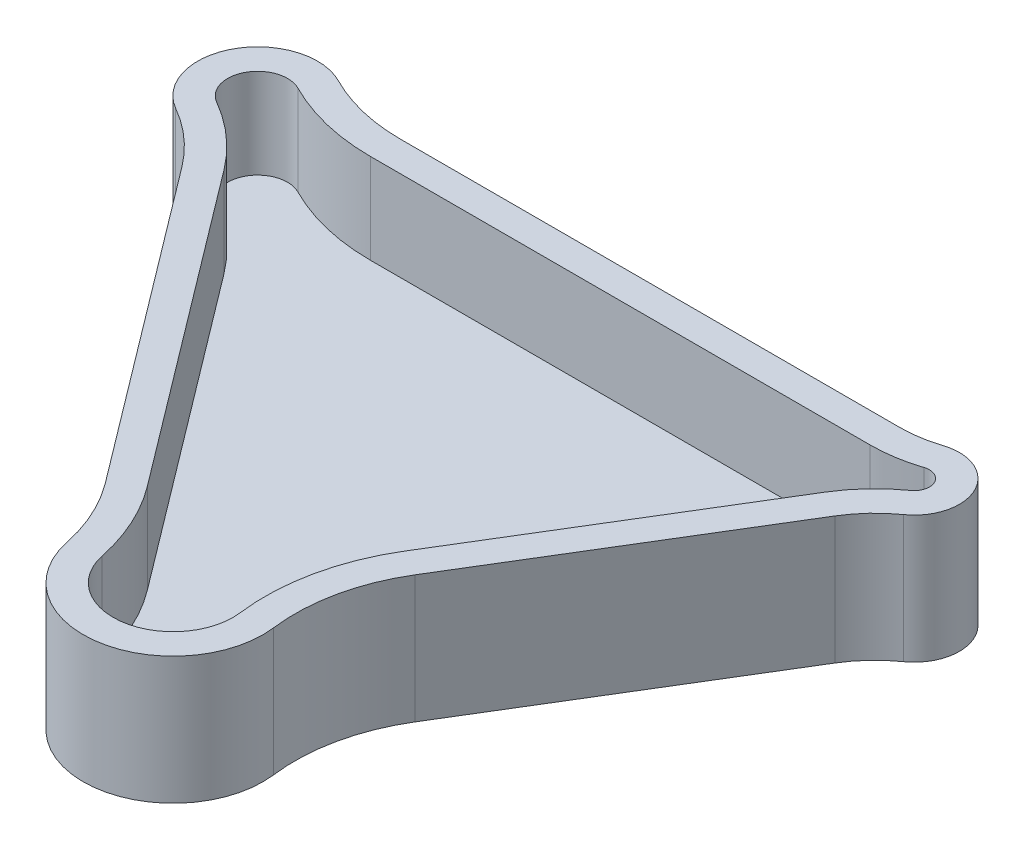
ISO-10303-21;
HEADER;
FILE_DESCRIPTION(('STEP AP214'),'2;1');
FILE_NAME('part.step','',(''),(''),'','','');
FILE_SCHEMA(('AUTOMOTIVE_DESIGN { 1 0 10303 214 1 1 1 1 }'));
ENDSEC;
DATA;
#1=APPLICATION_CONTEXT('core data for automotive mechanical design processes');
#2=APPLICATION_PROTOCOL_DEFINITION('international standard','automotive_design',2000,#1);
#3=PRODUCT_CONTEXT('',#1,'mechanical');
#4=PRODUCT('Part','Part','',(#3));
#5=PRODUCT_RELATED_PRODUCT_CATEGORY('part','',(#4));
#6=PRODUCT_DEFINITION_FORMATION('','',#4);
#7=PRODUCT_DEFINITION_CONTEXT('part definition',#1,'design');
#8=PRODUCT_DEFINITION('design','',#6,#7);
#9=PRODUCT_DEFINITION_SHAPE('','',#8);
#10=(LENGTH_UNIT() NAMED_UNIT(*) SI_UNIT(.MILLI.,.METRE.));
#11=(NAMED_UNIT(*) PLANE_ANGLE_UNIT() SI_UNIT($,.RADIAN.));
#12=(NAMED_UNIT(*) SI_UNIT($,.STERADIAN.) SOLID_ANGLE_UNIT());
#13=UNCERTAINTY_MEASURE_WITH_UNIT(LENGTH_MEASURE(1.E-05),#10,'distance_accuracy_value','');
#14=(GEOMETRIC_REPRESENTATION_CONTEXT(3) GLOBAL_UNCERTAINTY_ASSIGNED_CONTEXT((#13)) GLOBAL_UNIT_ASSIGNED_CONTEXT((#10,
#11,#12)) REPRESENTATION_CONTEXT('',''));
#15=CARTESIAN_POINT('',(0.,0.,0.));
#16=DIRECTION('',(0.,0.,1.));
#17=DIRECTION('',(1.,0.,0.));
#18=AXIS2_PLACEMENT_3D('',#15,#16,#17);
#19=CARTESIAN_POINT('',(-65.3082975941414,15.875,-204.297699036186));
#20=DIRECTION('',(0.,-1.,0.));
#21=DIRECTION('',(0.,0.,-1.));
#22=AXIS2_PLACEMENT_3D('',#19,#20,#21);
#23=CYLINDRICAL_SURFACE('',#22,76.2);
#24=CARTESIAN_POINT('',(-65.3082975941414,0.,-204.297699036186));
#25=DIRECTION('',(0.,-1.,0.));
#26=DIRECTION('',(0.,0.,-1.));
#27=AXIS2_PLACEMENT_3D('',#24,#25,#26);
#28=CIRCLE('',#27,76.2);
#29=CARTESIAN_POINT('',(-65.3082975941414,0.,-128.097699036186));
#30=VERTEX_POINT('',#29);
#31=CARTESIAN_POINT('',(-99.9059419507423,0.,-136.404820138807));
#32=VERTEX_POINT('',#31);
#33=EDGE_CURVE('E390',#30,#32,#28,.T.);
#34=ORIENTED_EDGE('',*,*,#33,.T.);
#35=DIRECTION('',(0.,-1.,0.));
#36=VECTOR('',#35,1.);
#37=CARTESIAN_POINT('',(-99.9059419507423,15.875,-136.404820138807));
#38=LINE('',#37,#36);
#39=CARTESIAN_POINT('',(-99.9059419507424,53.975,-136.404820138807));
#40=VERTEX_POINT('',#39);
#41=EDGE_CURVE('E12',#40,#32,#38,.T.);
#42=ORIENTED_EDGE('',*,*,#41,.F.);
#43=CARTESIAN_POINT('',(-65.3082975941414,53.975,-204.297699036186));
#44=DIRECTION('',(0.,-1.,0.));
#45=DIRECTION('',(0.,0.,1.));
#46=AXIS2_PLACEMENT_3D('',#43,#44,#45);
#47=CIRCLE('',#46,76.2);
#48=CARTESIAN_POINT('',(-65.3082975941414,53.975,-128.097699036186));
#49=VERTEX_POINT('',#48);
#50=EDGE_CURVE('E387',#49,#40,#47,.T.);
#51=ORIENTED_EDGE('',*,*,#50,.F.);
#52=DIRECTION('',(0.,-1.,0.));
#53=VECTOR('',#52,1.);
#54=CARTESIAN_POINT('',(-65.3082975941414,15.875,-128.097699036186));
#55=LINE('',#54,#53);
#56=EDGE_CURVE('E414',#49,#30,#55,.T.);
#57=ORIENTED_EDGE('',*,*,#56,.T.);
#58=EDGE_LOOP('',(#34,#42,#51,#57));
#59=FACE_BOUND('',#58,.T.);
#60=ADVANCED_FACE('F98',(#59),#23,.F.);
#61=CARTESIAN_POINT('',(-111.438490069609,15.875,-113.773860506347));
#62=DIRECTION('',(0.,-1.,0.));
#63=DIRECTION('',(0.,0.,-1.));
#64=AXIS2_PLACEMENT_3D('',#61,#62,#63);
#65=CYLINDRICAL_SURFACE('',#64,25.4);
#66=CARTESIAN_POINT('',(-111.438490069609,0.,-113.773860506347));
#67=DIRECTION('',(0.,1.,0.));
#68=DIRECTION('',(0.,0.,1.));
#69=AXIS2_PLACEMENT_3D('',#66,#67,#68);
#70=CIRCLE('',#69,25.4);
#71=CARTESIAN_POINT('',(-124.137797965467,0.,-91.7764156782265));
#72=VERTEX_POINT('',#71);
#73=EDGE_CURVE('E393',#32,#72,#70,.T.);
#74=ORIENTED_EDGE('',*,*,#73,.T.);
#75=DIRECTION('',(0.,-1.,0.));
#76=VECTOR('',#75,1.);
#77=CARTESIAN_POINT('',(-124.137797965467,15.875,-91.7764156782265));
#78=LINE('',#77,#76);
#79=CARTESIAN_POINT('',(-124.137797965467,53.975,-91.7764156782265));
#80=VERTEX_POINT('',#79);
#81=EDGE_CURVE('E105',#80,#72,#78,.T.);
#82=ORIENTED_EDGE('',*,*,#81,.F.);
#83=CARTESIAN_POINT('',(-111.438490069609,53.975,-113.773860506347));
#84=DIRECTION('',(0.,1.,0.));
#85=DIRECTION('',(0.,0.,1.));
#86=AXIS2_PLACEMENT_3D('',#83,#84,#85);
#87=CIRCLE('',#86,25.4);
#88=EDGE_CURVE('E279',#40,#80,#87,.T.);
#89=ORIENTED_EDGE('',*,*,#88,.F.);
#90=ORIENTED_EDGE('',*,*,#41,.T.);
#91=EDGE_LOOP('',(#74,#82,#89,#90));
#92=FACE_BOUND('',#91,.T.);
#93=ADVANCED_FACE('F490',(#92),#65,.T.);
#94=CARTESIAN_POINT('',(-162.235721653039,15.875,-25.7840811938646));
#95=DIRECTION('',(0.,-1.,0.));
#96=DIRECTION('',(0.,0.,-1.));
#97=AXIS2_PLACEMENT_3D('',#94,#95,#96);
#98=CYLINDRICAL_SURFACE('',#97,76.2);
#99=CARTESIAN_POINT('',(-162.235721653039,0.,-25.7840811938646));
#100=DIRECTION('',(0.,-1.,0.));
#101=DIRECTION('',(0.,0.,1.));
#102=AXIS2_PLACEMENT_3D('',#99,#100,#101);
#103=CIRCLE('',#102,76.2);
#104=CARTESIAN_POINT('',(-101.411749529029,0.,-71.6848918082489));
#105=VERTEX_POINT('',#104);
#106=EDGE_CURVE('E395',#72,#105,#103,.T.);
#107=ORIENTED_EDGE('',*,*,#106,.T.);
#108=DIRECTION('',(0.,-1.,0.));
#109=VECTOR('',#108,1.);
#110=CARTESIAN_POINT('',(-101.411749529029,15.875,-71.6848918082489));
#111=LINE('',#110,#109);
#112=CARTESIAN_POINT('',(-101.411749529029,53.975,-71.6848918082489));
#113=VERTEX_POINT('',#112);
#114=EDGE_CURVE('E439',#113,#105,#111,.T.);
#115=ORIENTED_EDGE('',*,*,#114,.F.);
#116=CARTESIAN_POINT('',(-162.235721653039,53.975,-25.7840811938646));
#117=DIRECTION('',(0.,-1.,0.));
#118=DIRECTION('',(0.,0.,1.));
#119=AXIS2_PLACEMENT_3D('',#116,#117,#118);
#120=CIRCLE('',#119,76.2);
#121=EDGE_CURVE('E357',#80,#113,#120,.T.);
#122=ORIENTED_EDGE('',*,*,#121,.F.);
#123=ORIENTED_EDGE('',*,*,#81,.T.);
#124=EDGE_LOOP('',(#107,#115,#122,#123));
#125=FACE_BOUND('',#124,.T.);
#126=ADVANCED_FACE('F445',(#125),#98,.F.);
#127=CARTESIAN_POINT('',(-1.65235802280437,15.875,60.508033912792));
#128=DIRECTION('',(0.798214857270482,0.,-0.602372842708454));
#129=DIRECTION('',(-0.602372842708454,0.,-0.798214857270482));
#130=AXIS2_PLACEMENT_3D('',#127,#128,#129);
#131=PLANE('',#130);
#132=DIRECTION('',(0.602372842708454,0.,0.798214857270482));
#133=VECTOR('',#132,1.);
#134=CARTESIAN_POINT('',(-1.65235802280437,0.,60.508033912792));
#135=LINE('',#134,#133);
#136=CARTESIAN_POINT('',(-1.65235802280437,0.,60.508033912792));
#137=VERTEX_POINT('',#136);
#138=EDGE_CURVE('E397',#105,#137,#135,.T.);
#139=ORIENTED_EDGE('',*,*,#138,.T.);
#140=DIRECTION('',(0.,-1.,0.));
#141=VECTOR('',#140,1.);
#142=CARTESIAN_POINT('',(-1.65235802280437,15.875,60.508033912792));
#143=LINE('',#142,#141);
#144=CARTESIAN_POINT('',(-1.65235802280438,53.975,60.508033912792));
#145=VERTEX_POINT('',#144);
#146=EDGE_CURVE('E436',#145,#137,#143,.T.);
#147=ORIENTED_EDGE('',*,*,#146,.F.);
#148=DIRECTION('',(0.602372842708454,0.,0.798214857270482));
#149=VECTOR('',#148,1.);
#150=CARTESIAN_POINT('',(-101.411749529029,53.975,-71.6848918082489));
#151=LINE('',#150,#149);
#152=EDGE_CURVE('E360',#113,#145,#151,.T.);
#153=ORIENTED_EDGE('',*,*,#152,.F.);
#154=ORIENTED_EDGE('',*,*,#114,.T.);
#155=EDGE_LOOP('',(#139,#147,#153,#154));
#156=FACE_BOUND('',#155,.T.);
#157=ADVANCED_FACE('F455',(#156),#131,.F.);
#158=CARTESIAN_POINT('',(-62.4763301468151,15.875,106.408844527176));
#159=DIRECTION('',(0.,-1.,0.));
#160=DIRECTION('',(0.,0.,-1.));
#161=AXIS2_PLACEMENT_3D('',#158,#159,#160);
#162=CYLINDRICAL_SURFACE('',#161,76.2);
#163=CARTESIAN_POINT('',(-62.4763301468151,0.,106.408844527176));
#164=DIRECTION('',(0.,-1.,0.));
#165=DIRECTION('',(0.,0.,1.));
#166=AXIS2_PLACEMENT_3D('',#163,#164,#165);
#167=CIRCLE('',#166,76.2);
#168=CARTESIAN_POINT('',(12.0862435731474,0.,90.6969827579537));
#169=VERTEX_POINT('',#168);
#170=EDGE_CURVE('E399',#137,#169,#167,.T.);
#171=ORIENTED_EDGE('',*,*,#170,.T.);
#172=DIRECTION('',(0.,-1.,0.));
#173=VECTOR('',#172,1.);
#174=CARTESIAN_POINT('',(12.0862435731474,15.875,90.6969827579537));
#175=LINE('',#174,#173);
#176=CARTESIAN_POINT('',(12.0862435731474,53.975,90.6969827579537));
#177=VERTEX_POINT('',#176);
#178=EDGE_CURVE('E433',#177,#169,#175,.T.);
#179=ORIENTED_EDGE('',*,*,#178,.F.);
#180=CARTESIAN_POINT('',(-62.4763301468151,53.975,106.408844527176));
#181=DIRECTION('',(0.,-1.,0.));
#182=DIRECTION('',(0.,0.,1.));
#183=AXIS2_PLACEMENT_3D('',#180,#181,#182);
#184=CIRCLE('',#183,76.2);
#185=EDGE_CURVE('E363',#145,#177,#184,.T.);
#186=ORIENTED_EDGE('',*,*,#185,.F.);
#187=ORIENTED_EDGE('',*,*,#146,.T.);
#188=EDGE_LOOP('',(#171,#179,#186,#187));
#189=FACE_BOUND('',#188,.T.);
#190=ADVANCED_FACE('F459',(#189),#162,.F.);
#191=CARTESIAN_POINT('',(49.3675304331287,15.875,82.8410518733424));
#192=DIRECTION('',(0.,-1.,0.));
#193=DIRECTION('',(0.,0.,-1.));
#194=AXIS2_PLACEMENT_3D('',#191,#192,#193);
#195=CYLINDRICAL_SURFACE('',#194,38.1);
#196=CARTESIAN_POINT('',(49.3675304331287,0.,82.8410518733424));
#197=DIRECTION('',(0.,1.,0.));
#198=DIRECTION('',(0.,0.,-1.));
#199=AXIS2_PLACEMENT_3D('',#196,#197,#198);
#200=CIRCLE('',#199,38.1);
#201=CARTESIAN_POINT('',(87.1602823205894,0.,78.0121902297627));
#202=VERTEX_POINT('',#201);
#203=EDGE_CURVE('E401',#169,#202,#200,.T.);
#204=ORIENTED_EDGE('',*,*,#203,.T.);
#205=DIRECTION('',(0.,-1.,0.));
#206=VECTOR('',#205,1.);
#207=CARTESIAN_POINT('',(87.1602823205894,15.875,78.0121902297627));
#208=LINE('',#207,#206);
#209=CARTESIAN_POINT('',(87.1602823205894,53.975,78.0121902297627));
#210=VERTEX_POINT('',#209);
#211=EDGE_CURVE('E430',#210,#202,#208,.T.);
#212=ORIENTED_EDGE('',*,*,#211,.F.);
#213=CARTESIAN_POINT('',(49.3675304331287,53.975,82.8410518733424));
#214=DIRECTION('',(0.,1.,0.));
#215=DIRECTION('',(0.,0.,1.));
#216=AXIS2_PLACEMENT_3D('',#213,#214,#215);
#217=CIRCLE('',#216,38.1);
#218=EDGE_CURVE('E366',#177,#210,#217,.T.);
#219=ORIENTED_EDGE('',*,*,#218,.F.);
#220=ORIENTED_EDGE('',*,*,#178,.T.);
#221=EDGE_LOOP('',(#204,#212,#219,#220));
#222=FACE_BOUND('',#221,.T.);
#223=ADVANCED_FACE('F466',(#222),#195,.T.);
#224=CARTESIAN_POINT('',(162.745786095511,15.875,68.3544669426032));
#225=DIRECTION('',(0.,-1.,0.));
#226=DIRECTION('',(0.,0.,-1.));
#227=AXIS2_PLACEMENT_3D('',#224,#225,#226);
#228=CYLINDRICAL_SURFACE('',#227,76.2);
#229=CARTESIAN_POINT('',(162.745786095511,0.,68.3544669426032));
#230=DIRECTION('',(0.,-1.,0.));
#231=DIRECTION('',(0.,0.,1.));
#232=AXIS2_PLACEMENT_3D('',#229,#230,#231);
#233=CIRCLE('',#232,76.2);
#234=CARTESIAN_POINT('',(97.6662128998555,0.,28.717499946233));
#235=VERTEX_POINT('',#234);
#236=EDGE_CURVE('E403',#202,#235,#233,.T.);
#237=ORIENTED_EDGE('',*,*,#236,.T.);
#238=DIRECTION('',(0.,-1.,0.));
#239=VECTOR('',#238,1.);
#240=CARTESIAN_POINT('',(97.6662128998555,15.875,28.717499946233));
#241=LINE('',#240,#239);
#242=CARTESIAN_POINT('',(97.6662128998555,53.975,28.717499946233));
#243=VERTEX_POINT('',#242);
#244=EDGE_CURVE('E427',#243,#235,#241,.T.);
#245=ORIENTED_EDGE('',*,*,#244,.F.);
#246=CARTESIAN_POINT('',(162.745786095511,53.975,68.3544669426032));
#247=DIRECTION('',(0.,-1.,0.));
#248=DIRECTION('',(0.,0.,1.));
#249=AXIS2_PLACEMENT_3D('',#246,#247,#248);
#250=CIRCLE('',#249,76.2);
#251=EDGE_CURVE('E369',#210,#243,#250,.T.);
#252=ORIENTED_EDGE('',*,*,#251,.F.);
#253=ORIENTED_EDGE('',*,*,#211,.T.);
#254=EDGE_LOOP('',(#237,#245,#252,#253));
#255=FACE_BOUND('',#254,.T.);
#256=ADVANCED_FACE('F469',(#255),#228,.F.);
#257=CARTESIAN_POINT('',(165.026329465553,15.875,-81.8804586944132));
#258=DIRECTION('',(-0.85406264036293,0.,-0.52017017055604));
#259=DIRECTION('',(-0.52017017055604,0.,0.854062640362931));
#260=AXIS2_PLACEMENT_3D('',#257,#258,#259);
#261=PLANE('',#260);
#262=DIRECTION('',(0.52017017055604,0.,-0.85406264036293));
#263=VECTOR('',#262,1.);
#264=CARTESIAN_POINT('',(165.026329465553,0.,-81.8804586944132));
#265=LINE('',#264,#263);
#266=CARTESIAN_POINT('',(165.026329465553,0.,-81.8804586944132));
#267=VERTEX_POINT('',#266);
#268=EDGE_CURVE('E405',#235,#267,#265,.T.);
#269=ORIENTED_EDGE('',*,*,#268,.T.);
#270=DIRECTION('',(0.,-1.,0.));
#271=VECTOR('',#270,1.);
#272=CARTESIAN_POINT('',(165.026329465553,15.875,-81.8804586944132));
#273=LINE('',#272,#271);
#274=CARTESIAN_POINT('',(165.026329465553,53.975,-81.8804586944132));
#275=VERTEX_POINT('',#274);
#276=EDGE_CURVE('E424',#275,#267,#273,.T.);
#277=ORIENTED_EDGE('',*,*,#276,.F.);
#278=DIRECTION('',(0.52017017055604,0.,-0.854062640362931));
#279=VECTOR('',#278,1.);
#280=CARTESIAN_POINT('',(97.6662128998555,53.975,28.717499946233));
#281=LINE('',#280,#279);
#282=EDGE_CURVE('E372',#243,#275,#281,.T.);
#283=ORIENTED_EDGE('',*,*,#282,.F.);
#284=ORIENTED_EDGE('',*,*,#244,.T.);
#285=EDGE_LOOP('',(#269,#277,#283,#284));
#286=FACE_BOUND('',#285,.T.);
#287=ADVANCED_FACE('F474',(#286),#261,.F.);
#288=CARTESIAN_POINT('',(208.41271159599,15.875,-55.4558140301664));
#289=DIRECTION('',(0.,-1.,0.));
#290=DIRECTION('',(0.,0.,-1.));
#291=AXIS2_PLACEMENT_3D('',#288,#289,#290);
#292=CYLINDRICAL_SURFACE('',#291,50.8);
#293=CARTESIAN_POINT('',(208.41271159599,0.,-55.4558140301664));
#294=DIRECTION('',(0.,-1.,0.));
#295=DIRECTION('',(0.,0.,1.));
#296=AXIS2_PLACEMENT_3D('',#293,#294,#295);
#297=CIRCLE('',#296,50.8);
#298=CARTESIAN_POINT('',(179.098460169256,0.,-96.9445433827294));
#299=VERTEX_POINT('',#298);
#300=EDGE_CURVE('E407',#267,#299,#297,.T.);
#301=ORIENTED_EDGE('',*,*,#300,.T.);
#302=DIRECTION('',(0.,-1.,0.));
#303=VECTOR('',#302,1.);
#304=CARTESIAN_POINT('',(179.098460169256,15.875,-96.9445433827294));
#305=LINE('',#304,#303);
#306=CARTESIAN_POINT('',(179.098460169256,53.975,-96.9445433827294));
#307=VERTEX_POINT('',#306);
#308=EDGE_CURVE('E421',#307,#299,#305,.T.);
#309=ORIENTED_EDGE('',*,*,#308,.F.);
#310=CARTESIAN_POINT('',(208.41271159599,53.975,-55.4558140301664));
#311=DIRECTION('',(0.,-1.,0.));
#312=DIRECTION('',(0.,0.,1.));
#313=AXIS2_PLACEMENT_3D('',#310,#311,#312);
#314=CIRCLE('',#313,50.8);
#315=EDGE_CURVE('E375',#275,#307,#314,.T.);
#316=ORIENTED_EDGE('',*,*,#315,.F.);
#317=ORIENTED_EDGE('',*,*,#276,.T.);
#318=EDGE_LOOP('',(#301,#309,#316,#317));
#319=FACE_BOUND('',#318,.T.);
#320=ADVANCED_FACE('F478',(#319),#292,.F.);
#321=CARTESIAN_POINT('',(168.105615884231,15.875,-112.502816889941));
#322=DIRECTION('',(0.,-1.,0.));
#323=DIRECTION('',(0.,0.,-1.));
#324=AXIS2_PLACEMENT_3D('',#321,#322,#323);
#325=CYLINDRICAL_SURFACE('',#324,19.05);
#326=CARTESIAN_POINT('',(168.105615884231,0.,-112.502816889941));
#327=DIRECTION('',(0.,1.,0.));
#328=DIRECTION('',(0.,0.,-1.));
#329=AXIS2_PLACEMENT_3D('',#326,#327,#328);
#330=CIRCLE('',#329,19.05);
#331=CARTESIAN_POINT('',(162.188363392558,0.,-130.610512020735));
#332=VERTEX_POINT('',#331);
#333=EDGE_CURVE('E409',#299,#332,#330,.T.);
#334=ORIENTED_EDGE('',*,*,#333,.T.);
#335=DIRECTION('',(0.,-1.,0.));
#336=VECTOR('',#335,1.);
#337=CARTESIAN_POINT('',(162.188363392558,15.875,-130.610512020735));
#338=LINE('',#337,#336);
#339=CARTESIAN_POINT('',(162.188363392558,53.975,-130.610512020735));
#340=VERTEX_POINT('',#339);
#341=EDGE_CURVE('E418',#340,#332,#338,.T.);
#342=ORIENTED_EDGE('',*,*,#341,.F.);
#343=CARTESIAN_POINT('',(168.105615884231,53.975,-112.502816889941));
#344=DIRECTION('',(0.,1.,0.));
#345=DIRECTION('',(0.,0.,1.));
#346=AXIS2_PLACEMENT_3D('',#343,#344,#345);
#347=CIRCLE('',#346,19.05);
#348=EDGE_CURVE('E378',#307,#340,#347,.T.);
#349=ORIENTED_EDGE('',*,*,#348,.F.);
#350=ORIENTED_EDGE('',*,*,#308,.T.);
#351=EDGE_LOOP('',(#334,#342,#349,#350));
#352=FACE_BOUND('',#351,.T.);
#353=ADVANCED_FACE('F482',(#352),#325,.T.);
#354=CARTESIAN_POINT('',(146.409023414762,15.875,-178.897699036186));
#355=DIRECTION('',(0.,-1.,0.));
#356=DIRECTION('',(0.,0.,-1.));
#357=AXIS2_PLACEMENT_3D('',#354,#355,#356);
#358=CYLINDRICAL_SURFACE('',#357,50.8);
#359=CARTESIAN_POINT('',(146.409023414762,0.,-178.897699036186));
#360=DIRECTION('',(0.,-1.,0.));
#361=DIRECTION('',(0.,0.,1.));
#362=AXIS2_PLACEMENT_3D('',#359,#360,#361);
#363=CIRCLE('',#362,50.8);
#364=CARTESIAN_POINT('',(146.409023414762,0.,-128.097699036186));
#365=VERTEX_POINT('',#364);
#366=EDGE_CURVE('E411',#332,#365,#363,.T.);
#367=ORIENTED_EDGE('',*,*,#366,.T.);
#368=DIRECTION('',(0.,-1.,0.));
#369=VECTOR('',#368,1.);
#370=CARTESIAN_POINT('',(146.409023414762,15.875,-128.097699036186));
#371=LINE('',#370,#369);
#372=CARTESIAN_POINT('',(146.409023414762,53.975,-128.097699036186));
#373=VERTEX_POINT('',#372);
#374=EDGE_CURVE('E416',#373,#365,#371,.T.);
#375=ORIENTED_EDGE('',*,*,#374,.F.);
#376=CARTESIAN_POINT('',(146.409023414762,53.975,-178.897699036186));
#377=DIRECTION('',(0.,-1.,0.));
#378=DIRECTION('',(0.,0.,1.));
#379=AXIS2_PLACEMENT_3D('',#376,#377,#378);
#380=CIRCLE('',#379,50.8);
#381=EDGE_CURVE('E381',#340,#373,#380,.T.);
#382=ORIENTED_EDGE('',*,*,#381,.F.);
#383=ORIENTED_EDGE('',*,*,#341,.T.);
#384=EDGE_LOOP('',(#367,#375,#382,#383));
#385=FACE_BOUND('',#384,.T.);
#386=ADVANCED_FACE('F485',(#385),#358,.F.);
#387=CARTESIAN_POINT('',(-65.3082975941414,15.875,-128.097699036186));
#388=DIRECTION('',(0.,0.,1.));
#389=DIRECTION('',(1.,0.,0.));
#390=AXIS2_PLACEMENT_3D('',#387,#388,#389);
#391=PLANE('',#390);
#392=DIRECTION('',(-1.,0.,0.));
#393=VECTOR('',#392,1.);
#394=CARTESIAN_POINT('',(-65.3082975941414,0.,-128.097699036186));
#395=LINE('',#394,#393);
#396=EDGE_CURVE('E120',#365,#30,#395,.T.);
#397=ORIENTED_EDGE('',*,*,#396,.T.);
#398=ORIENTED_EDGE('',*,*,#56,.F.);
#399=DIRECTION('',(-1.,0.,0.));
#400=VECTOR('',#399,1.);
#401=CARTESIAN_POINT('',(146.409023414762,53.975,-128.097699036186));
#402=LINE('',#401,#400);
#403=EDGE_CURVE('E384',#373,#49,#402,.T.);
#404=ORIENTED_EDGE('',*,*,#403,.F.);
#405=ORIENTED_EDGE('',*,*,#374,.T.);
#406=EDGE_LOOP('',(#397,#398,#404,#405));
#407=FACE_BOUND('',#406,.T.);
#408=ADVANCED_FACE('F489',(#407),#391,.F.);
#409=CARTESIAN_POINT('',(-65.3082975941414,0.,-204.297699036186));
#410=DIRECTION('',(0.,-1.,0.));
#411=DIRECTION('',(0.,0.,-1.));
#412=AXIS2_PLACEMENT_3D('',#409,#410,#411);
#413=PLANE('',#412);
#414=ORIENTED_EDGE('',*,*,#33,.F.);
#415=ORIENTED_EDGE('',*,*,#396,.F.);
#416=ORIENTED_EDGE('',*,*,#366,.F.);
#417=ORIENTED_EDGE('',*,*,#333,.F.);
#418=ORIENTED_EDGE('',*,*,#300,.F.);
#419=ORIENTED_EDGE('',*,*,#268,.F.);
#420=ORIENTED_EDGE('',*,*,#236,.F.);
#421=ORIENTED_EDGE('',*,*,#203,.F.);
#422=ORIENTED_EDGE('',*,*,#170,.F.);
#423=ORIENTED_EDGE('',*,*,#138,.F.);
#424=ORIENTED_EDGE('',*,*,#106,.F.);
#425=ORIENTED_EDGE('',*,*,#73,.F.);
#426=EDGE_LOOP('',(#414,#415,#416,#417,#418,#419,#420,#421,#422,#423,#424,#425));
#427=FACE_BOUND('',#426,.T.);
#428=ADVANCED_FACE('F451',(#427),#413,.T.);
#429=CARTESIAN_POINT('',(-111.438490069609,53.975,-113.773860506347));
#430=DIRECTION('',(0.,1.,0.));
#431=DIRECTION('',(0.,0.,1.));
#432=AXIS2_PLACEMENT_3D('',#429,#430,#431);
#433=PLANE('',#432);
#434=ORIENTED_EDGE('',*,*,#88,.T.);
#435=ORIENTED_EDGE('',*,*,#121,.T.);
#436=ORIENTED_EDGE('',*,*,#152,.T.);
#437=ORIENTED_EDGE('',*,*,#185,.T.);
#438=ORIENTED_EDGE('',*,*,#218,.T.);
#439=ORIENTED_EDGE('',*,*,#251,.T.);
#440=ORIENTED_EDGE('',*,*,#282,.T.);
#441=ORIENTED_EDGE('',*,*,#315,.T.);
#442=ORIENTED_EDGE('',*,*,#348,.T.);
#443=ORIENTED_EDGE('',*,*,#381,.T.);
#444=ORIENTED_EDGE('',*,*,#403,.T.);
#445=ORIENTED_EDGE('',*,*,#50,.T.);
#446=EDGE_LOOP('',(#434,#435,#436,#437,#438,#439,#440,#441,#442,#443,#444,#445));
#447=FACE_BOUND('',#446,.T.);
#448=CARTESIAN_POINT('',(-162.235721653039,53.975,-25.7840811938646));
#449=DIRECTION('',(0.,1.,0.));
#450=DIRECTION('',(-1.,0.,0.));
#451=AXIS2_PLACEMENT_3D('',#448,#449,#450);
#452=CIRCLE('',#451,88.9);
#453=CARTESIAN_POINT('',(-117.788144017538,53.975,-102.775138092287));
#454=VERTEX_POINT('',#453);
#455=CARTESIAN_POINT('',(-91.2744208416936,53.975,-79.3350269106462));
#456=VERTEX_POINT('',#455);
#457=EDGE_CURVE('E312',#454,#456,#452,.F.);
#458=ORIENTED_EDGE('',*,*,#457,.F.);
#459=CARTESIAN_POINT('',(-111.438490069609,53.975,-113.773860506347));
#460=DIRECTION('',(0.,1.,0.));
#461=DIRECTION('',(-1.,0.,0.));
#462=AXIS2_PLACEMENT_3D('',#459,#460,#461);
#463=CIRCLE('',#462,12.7);
#464=CARTESIAN_POINT('',(-105.672216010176,53.975,-125.089340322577));
#465=VERTEX_POINT('',#464);
#466=EDGE_CURVE('E278',#465,#454,#463,.T.);
#467=ORIENTED_EDGE('',*,*,#466,.F.);
#468=CARTESIAN_POINT('',(-65.3082975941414,53.975,-204.297699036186));
#469=DIRECTION('',(0.,1.,0.));
#470=DIRECTION('',(-1.,0.,0.));
#471=AXIS2_PLACEMENT_3D('',#468,#469,#470);
#472=CIRCLE('',#471,88.9);
#473=CARTESIAN_POINT('',(-65.3082975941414,53.975,-115.397699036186));
#474=VERTEX_POINT('',#473);
#475=EDGE_CURVE('E333',#474,#465,#472,.F.);
#476=ORIENTED_EDGE('',*,*,#475,.F.);
#477=DIRECTION('',(-1.,0.,0.));
#478=VECTOR('',#477,1.);
#479=CARTESIAN_POINT('',(146.409023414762,53.975,-115.397699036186));
#480=LINE('',#479,#478);
#481=CARTESIAN_POINT('',(146.409023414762,53.975,-115.397699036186));
#482=VERTEX_POINT('',#481);
#483=EDGE_CURVE('E330',#482,#474,#480,.T.);
#484=ORIENTED_EDGE('',*,*,#483,.F.);
#485=CARTESIAN_POINT('',(146.409023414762,53.975,-178.897699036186));
#486=DIRECTION('',(0.,1.,0.));
#487=DIRECTION('',(-1.,0.,0.));
#488=AXIS2_PLACEMENT_3D('',#485,#486,#487);
#489=CIRCLE('',#488,63.5);
#490=CARTESIAN_POINT('',(166.133198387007,53.975,-118.538715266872));
#491=VERTEX_POINT('',#490);
#492=EDGE_CURVE('E328',#491,#482,#489,.F.);
#493=ORIENTED_EDGE('',*,*,#492,.F.);
#494=CARTESIAN_POINT('',(168.105615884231,53.975,-112.502816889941));
#495=DIRECTION('',(0.,1.,0.));
#496=DIRECTION('',(-1.,0.,0.));
#497=AXIS2_PLACEMENT_3D('',#494,#495,#496);
#498=CIRCLE('',#497,6.35);
#499=CARTESIAN_POINT('',(171.769897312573,53.975,-107.31672572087));
#500=VERTEX_POINT('',#499);
#501=EDGE_CURVE('E326',#500,#491,#498,.T.);
#502=ORIENTED_EDGE('',*,*,#501,.F.);
#503=CARTESIAN_POINT('',(208.41271159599,53.975,-55.4558140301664));
#504=DIRECTION('',(0.,1.,0.));
#505=DIRECTION('',(-1.,0.,0.));
#506=AXIS2_PLACEMENT_3D('',#503,#504,#505);
#507=CIRCLE('',#506,63.5);
#508=CARTESIAN_POINT('',(154.179733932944,53.975,-88.4866198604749));
#509=VERTEX_POINT('',#508);
#510=EDGE_CURVE('E324',#509,#500,#507,.F.);
#511=ORIENTED_EDGE('',*,*,#510,.F.);
#512=DIRECTION('',(0.52017017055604,0.,-0.854062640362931));
#513=VECTOR('',#512,1.);
#514=CARTESIAN_POINT('',(86.8196173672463,53.975,22.1113387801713));
#515=LINE('',#514,#513);
#516=CARTESIAN_POINT('',(86.8196173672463,53.975,22.1113387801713));
#517=VERTEX_POINT('',#516);
#518=EDGE_CURVE('E322',#517,#509,#515,.T.);
#519=ORIENTED_EDGE('',*,*,#518,.F.);
#520=CARTESIAN_POINT('',(162.745786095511,53.975,68.3544669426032));
#521=DIRECTION('',(0.,1.,0.));
#522=DIRECTION('',(-1.,0.,0.));
#523=AXIS2_PLACEMENT_3D('',#520,#521,#522);
#524=CIRCLE('',#523,88.9);
#525=CARTESIAN_POINT('',(74.5626983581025,53.975,79.6218107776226));
#526=VERTEX_POINT('',#525);
#527=EDGE_CURVE('E320',#526,#517,#524,.F.);
#528=ORIENTED_EDGE('',*,*,#527,.F.);
#529=CARTESIAN_POINT('',(49.3675304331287,53.975,82.8410518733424));
#530=DIRECTION('',(0.,1.,0.));
#531=DIRECTION('',(-1.,0.,0.));
#532=AXIS2_PLACEMENT_3D('',#529,#530,#531);
#533=CIRCLE('',#532,25.4);
#534=CARTESIAN_POINT('',(24.5133391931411,53.975,88.07833912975));
#535=VERTEX_POINT('',#534);
#536=EDGE_CURVE('E318',#535,#526,#533,.T.);
#537=ORIENTED_EDGE('',*,*,#536,.F.);
#538=CARTESIAN_POINT('',(-62.4763301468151,53.975,106.408844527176));
#539=DIRECTION('',(0.,1.,0.));
#540=DIRECTION('',(-1.,0.,0.));
#541=AXIS2_PLACEMENT_3D('',#538,#539,#540);
#542=CIRCLE('',#541,88.9);
#543=CARTESIAN_POINT('',(8.48497066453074,53.975,52.8578988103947));
#544=VERTEX_POINT('',#543);
#545=EDGE_CURVE('E316',#544,#535,#542,.F.);
#546=ORIENTED_EDGE('',*,*,#545,.F.);
#547=DIRECTION('',(0.602372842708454,0.,0.798214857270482));
#548=VECTOR('',#547,1.);
#549=CARTESIAN_POINT('',(-91.2744208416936,53.975,-79.3350269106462));
#550=LINE('',#549,#548);
#551=EDGE_CURVE('E314',#456,#544,#550,.T.);
#552=ORIENTED_EDGE('',*,*,#551,.F.);
#553=EDGE_LOOP('',(#458,#467,#476,#484,#493,#502,#511,#519,#528,#537,#546,#552));
#554=FACE_BOUND('',#553,.T.);
#555=ADVANCED_FACE('F462',(#447,#554),#433,.T.);
#556=CARTESIAN_POINT('',(-111.438490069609,53.975,-113.773860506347));
#557=DIRECTION('',(0.,-1.,0.));
#558=DIRECTION('',(0.,0.,-1.));
#559=AXIS2_PLACEMENT_3D('',#556,#557,#558);
#560=CYLINDRICAL_SURFACE('',#559,12.7);
#561=CARTESIAN_POINT('',(-111.438490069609,15.875,-113.773860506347));
#562=DIRECTION('',(0.,1.,0.));
#563=DIRECTION('',(-1.,0.,0.));
#564=AXIS2_PLACEMENT_3D('',#561,#562,#563);
#565=CIRCLE('',#564,12.7);
#566=CARTESIAN_POINT('',(-105.672216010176,15.875,-125.089340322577));
#567=VERTEX_POINT('',#566);
#568=CARTESIAN_POINT('',(-117.788144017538,15.875,-102.775138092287));
#569=VERTEX_POINT('',#568);
#570=EDGE_CURVE('E272',#567,#569,#565,.T.);
#571=ORIENTED_EDGE('',*,*,#570,.F.);
#572=DIRECTION('',(0.,-1.,0.));
#573=VECTOR('',#572,1.);
#574=CARTESIAN_POINT('',(-105.672216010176,53.975,-125.089340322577));
#575=LINE('',#574,#573);
#576=EDGE_CURVE('E112',#465,#567,#575,.T.);
#577=ORIENTED_EDGE('',*,*,#576,.F.);
#578=ORIENTED_EDGE('',*,*,#466,.T.);
#579=DIRECTION('',(0.,-1.,0.));
#580=VECTOR('',#579,1.);
#581=CARTESIAN_POINT('',(-117.788144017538,53.975,-102.775138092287));
#582=LINE('',#581,#580);
#583=EDGE_CURVE('E263',#454,#569,#582,.T.);
#584=ORIENTED_EDGE('',*,*,#583,.T.);
#585=EDGE_LOOP('',(#571,#577,#578,#584));
#586=FACE_BOUND('',#585,.T.);
#587=ADVANCED_FACE('F275',(#586),#560,.F.);
#588=CARTESIAN_POINT('',(-162.235721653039,53.975,-25.7840811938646));
#589=DIRECTION('',(0.,-1.,0.));
#590=DIRECTION('',(0.,0.,-1.));
#591=AXIS2_PLACEMENT_3D('',#588,#589,#590);
#592=CYLINDRICAL_SURFACE('',#591,88.9);
#593=CARTESIAN_POINT('',(-162.235721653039,15.875,-25.7840811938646));
#594=DIRECTION('',(0.,1.,0.));
#595=DIRECTION('',(-1.,0.,0.));
#596=AXIS2_PLACEMENT_3D('',#593,#594,#595);
#597=CIRCLE('',#596,88.9);
#598=CARTESIAN_POINT('',(-91.2744208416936,15.875,-79.3350269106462));
#599=VERTEX_POINT('',#598);
#600=EDGE_CURVE('E260',#569,#599,#597,.F.);
#601=ORIENTED_EDGE('',*,*,#600,.F.);
#602=ORIENTED_EDGE('',*,*,#583,.F.);
#603=ORIENTED_EDGE('',*,*,#457,.T.);
#604=DIRECTION('',(0.,-1.,0.));
#605=VECTOR('',#604,1.);
#606=CARTESIAN_POINT('',(-91.2744208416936,53.975,-79.3350269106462));
#607=LINE('',#606,#605);
#608=EDGE_CURVE('E266',#456,#599,#607,.T.);
#609=ORIENTED_EDGE('',*,*,#608,.T.);
#610=EDGE_LOOP('',(#601,#602,#603,#609));
#611=FACE_BOUND('',#610,.T.);
#612=ADVANCED_FACE('F262',(#611),#592,.T.);
#613=CARTESIAN_POINT('',(-91.2744208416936,53.975,-79.3350269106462));
#614=DIRECTION('',(0.798214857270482,0.,-0.602372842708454));
#615=DIRECTION('',(-0.602372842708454,0.,-0.798214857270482));
#616=AXIS2_PLACEMENT_3D('',#613,#614,#615);
#617=PLANE('',#616);
#618=DIRECTION('',(0.602372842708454,0.,0.798214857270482));
#619=VECTOR('',#618,1.);
#620=CARTESIAN_POINT('',(-91.2744208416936,15.875,-79.3350269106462));
#621=LINE('',#620,#619);
#622=CARTESIAN_POINT('',(8.48497066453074,15.875,52.8578988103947));
#623=VERTEX_POINT('',#622);
#624=EDGE_CURVE('E271',#599,#623,#621,.T.);
#625=ORIENTED_EDGE('',*,*,#624,.F.);
#626=ORIENTED_EDGE('',*,*,#608,.F.);
#627=ORIENTED_EDGE('',*,*,#551,.T.);
#628=DIRECTION('',(0.,-1.,0.));
#629=VECTOR('',#628,1.);
#630=CARTESIAN_POINT('',(8.48497066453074,53.975,52.8578988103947));
#631=LINE('',#630,#629);
#632=EDGE_CURVE('E352',#544,#623,#631,.T.);
#633=ORIENTED_EDGE('',*,*,#632,.T.);
#634=EDGE_LOOP('',(#625,#626,#627,#633));
#635=FACE_BOUND('',#634,.T.);
#636=ADVANCED_FACE('F527',(#635),#617,.T.);
#637=CARTESIAN_POINT('',(-62.4763301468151,53.975,106.408844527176));
#638=DIRECTION('',(0.,-1.,0.));
#639=DIRECTION('',(0.,0.,-1.));
#640=AXIS2_PLACEMENT_3D('',#637,#638,#639);
#641=CYLINDRICAL_SURFACE('',#640,88.9);
#642=CARTESIAN_POINT('',(-62.4763301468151,15.875,106.408844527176));
#643=DIRECTION('',(0.,1.,0.));
#644=DIRECTION('',(-1.,0.,0.));
#645=AXIS2_PLACEMENT_3D('',#642,#643,#644);
#646=CIRCLE('',#645,88.9);
#647=CARTESIAN_POINT('',(24.5133391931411,15.875,88.07833912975));
#648=VERTEX_POINT('',#647);
#649=EDGE_CURVE('E287',#623,#648,#646,.F.);
#650=ORIENTED_EDGE('',*,*,#649,.F.);
#651=ORIENTED_EDGE('',*,*,#632,.F.);
#652=ORIENTED_EDGE('',*,*,#545,.T.);
#653=DIRECTION('',(0.,-1.,0.));
#654=VECTOR('',#653,1.);
#655=CARTESIAN_POINT('',(24.5133391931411,53.975,88.07833912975));
#656=LINE('',#655,#654);
#657=EDGE_CURVE('E350',#535,#648,#656,.T.);
#658=ORIENTED_EDGE('',*,*,#657,.T.);
#659=EDGE_LOOP('',(#650,#651,#652,#658));
#660=FACE_BOUND('',#659,.T.);
#661=ADVANCED_FACE('F530',(#660),#641,.T.);
#662=CARTESIAN_POINT('',(49.3675304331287,53.975,82.8410518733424));
#663=DIRECTION('',(0.,-1.,0.));
#664=DIRECTION('',(0.,0.,-1.));
#665=AXIS2_PLACEMENT_3D('',#662,#663,#664);
#666=CYLINDRICAL_SURFACE('',#665,25.4);
#667=CARTESIAN_POINT('',(49.3675304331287,15.875,82.8410518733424));
#668=DIRECTION('',(0.,1.,0.));
#669=DIRECTION('',(-1.,0.,0.));
#670=AXIS2_PLACEMENT_3D('',#667,#668,#669);
#671=CIRCLE('',#670,25.4);
#672=CARTESIAN_POINT('',(74.5626983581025,15.875,79.6218107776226));
#673=VERTEX_POINT('',#672);
#674=EDGE_CURVE('E290',#648,#673,#671,.T.);
#675=ORIENTED_EDGE('',*,*,#674,.F.);
#676=ORIENTED_EDGE('',*,*,#657,.F.);
#677=ORIENTED_EDGE('',*,*,#536,.T.);
#678=DIRECTION('',(0.,-1.,0.));
#679=VECTOR('',#678,1.);
#680=CARTESIAN_POINT('',(74.5626983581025,53.975,79.6218107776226));
#681=LINE('',#680,#679);
#682=EDGE_CURVE('E348',#526,#673,#681,.T.);
#683=ORIENTED_EDGE('',*,*,#682,.T.);
#684=EDGE_LOOP('',(#675,#676,#677,#683));
#685=FACE_BOUND('',#684,.T.);
#686=ADVANCED_FACE('F534',(#685),#666,.F.);
#687=CARTESIAN_POINT('',(162.745786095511,53.975,68.3544669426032));
#688=DIRECTION('',(0.,-1.,0.));
#689=DIRECTION('',(0.,0.,-1.));
#690=AXIS2_PLACEMENT_3D('',#687,#688,#689);
#691=CYLINDRICAL_SURFACE('',#690,88.9);
#692=CARTESIAN_POINT('',(162.745786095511,15.875,68.3544669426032));
#693=DIRECTION('',(0.,1.,0.));
#694=DIRECTION('',(-1.,0.,0.));
#695=AXIS2_PLACEMENT_3D('',#692,#693,#694);
#696=CIRCLE('',#695,88.9);
#697=CARTESIAN_POINT('',(86.8196173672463,15.875,22.1113387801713));
#698=VERTEX_POINT('',#697);
#699=EDGE_CURVE('E293',#673,#698,#696,.F.);
#700=ORIENTED_EDGE('',*,*,#699,.F.);
#701=ORIENTED_EDGE('',*,*,#682,.F.);
#702=ORIENTED_EDGE('',*,*,#527,.T.);
#703=DIRECTION('',(0.,-1.,0.));
#704=VECTOR('',#703,1.);
#705=CARTESIAN_POINT('',(86.8196173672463,53.975,22.1113387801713));
#706=LINE('',#705,#704);
#707=EDGE_CURVE('E346',#517,#698,#706,.T.);
#708=ORIENTED_EDGE('',*,*,#707,.T.);
#709=EDGE_LOOP('',(#700,#701,#702,#708));
#710=FACE_BOUND('',#709,.T.);
#711=ADVANCED_FACE('F538',(#710),#691,.T.);
#712=CARTESIAN_POINT('',(86.8196173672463,53.975,22.1113387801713));
#713=DIRECTION('',(-0.854062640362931,0.,-0.52017017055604));
#714=DIRECTION('',(-0.52017017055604,0.,0.854062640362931));
#715=AXIS2_PLACEMENT_3D('',#712,#713,#714);
#716=PLANE('',#715);
#717=DIRECTION('',(0.52017017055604,0.,-0.854062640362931));
#718=VECTOR('',#717,1.);
#719=CARTESIAN_POINT('',(86.8196173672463,15.875,22.1113387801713));
#720=LINE('',#719,#718);
#721=CARTESIAN_POINT('',(154.179733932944,15.875,-88.4866198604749));
#722=VERTEX_POINT('',#721);
#723=EDGE_CURVE('E296',#698,#722,#720,.T.);
#724=ORIENTED_EDGE('',*,*,#723,.F.);
#725=ORIENTED_EDGE('',*,*,#707,.F.);
#726=ORIENTED_EDGE('',*,*,#518,.T.);
#727=DIRECTION('',(0.,-1.,0.));
#728=VECTOR('',#727,1.);
#729=CARTESIAN_POINT('',(154.179733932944,53.975,-88.4866198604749));
#730=LINE('',#729,#728);
#731=EDGE_CURVE('E344',#509,#722,#730,.T.);
#732=ORIENTED_EDGE('',*,*,#731,.T.);
#733=EDGE_LOOP('',(#724,#725,#726,#732));
#734=FACE_BOUND('',#733,.T.);
#735=ADVANCED_FACE('F542',(#734),#716,.T.);
#736=CARTESIAN_POINT('',(208.41271159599,53.975,-55.4558140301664));
#737=DIRECTION('',(0.,-1.,0.));
#738=DIRECTION('',(0.,0.,-1.));
#739=AXIS2_PLACEMENT_3D('',#736,#737,#738);
#740=CYLINDRICAL_SURFACE('',#739,63.5);
#741=CARTESIAN_POINT('',(208.41271159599,15.875,-55.4558140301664));
#742=DIRECTION('',(0.,1.,0.));
#743=DIRECTION('',(-1.,0.,0.));
#744=AXIS2_PLACEMENT_3D('',#741,#742,#743);
#745=CIRCLE('',#744,63.5);
#746=CARTESIAN_POINT('',(171.769897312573,15.875,-107.31672572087));
#747=VERTEX_POINT('',#746);
#748=EDGE_CURVE('E299',#722,#747,#745,.F.);
#749=ORIENTED_EDGE('',*,*,#748,.F.);
#750=ORIENTED_EDGE('',*,*,#731,.F.);
#751=ORIENTED_EDGE('',*,*,#510,.T.);
#752=DIRECTION('',(0.,-1.,0.));
#753=VECTOR('',#752,1.);
#754=CARTESIAN_POINT('',(171.769897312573,53.975,-107.31672572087));
#755=LINE('',#754,#753);
#756=EDGE_CURVE('E342',#500,#747,#755,.T.);
#757=ORIENTED_EDGE('',*,*,#756,.T.);
#758=EDGE_LOOP('',(#749,#750,#751,#757));
#759=FACE_BOUND('',#758,.T.);
#760=ADVANCED_FACE('F546',(#759),#740,.T.);
#761=CARTESIAN_POINT('',(168.105615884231,53.975,-112.502816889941));
#762=DIRECTION('',(0.,-1.,0.));
#763=DIRECTION('',(0.,0.,-1.));
#764=AXIS2_PLACEMENT_3D('',#761,#762,#763);
#765=CYLINDRICAL_SURFACE('',#764,6.35);
#766=CARTESIAN_POINT('',(168.105615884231,15.875,-112.502816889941));
#767=DIRECTION('',(0.,1.,0.));
#768=DIRECTION('',(-1.,0.,0.));
#769=AXIS2_PLACEMENT_3D('',#766,#767,#768);
#770=CIRCLE('',#769,6.35);
#771=CARTESIAN_POINT('',(166.133198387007,15.875,-118.538715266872));
#772=VERTEX_POINT('',#771);
#773=EDGE_CURVE('E302',#747,#772,#770,.T.);
#774=ORIENTED_EDGE('',*,*,#773,.F.);
#775=ORIENTED_EDGE('',*,*,#756,.F.);
#776=ORIENTED_EDGE('',*,*,#501,.T.);
#777=DIRECTION('',(0.,-1.,0.));
#778=VECTOR('',#777,1.);
#779=CARTESIAN_POINT('',(166.133198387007,53.975,-118.538715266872));
#780=LINE('',#779,#778);
#781=EDGE_CURVE('E340',#491,#772,#780,.T.);
#782=ORIENTED_EDGE('',*,*,#781,.T.);
#783=EDGE_LOOP('',(#774,#775,#776,#782));
#784=FACE_BOUND('',#783,.T.);
#785=ADVANCED_FACE('F550',(#784),#765,.F.);
#786=CARTESIAN_POINT('',(146.409023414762,53.975,-178.897699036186));
#787=DIRECTION('',(0.,-1.,0.));
#788=DIRECTION('',(0.,0.,-1.));
#789=AXIS2_PLACEMENT_3D('',#786,#787,#788);
#790=CYLINDRICAL_SURFACE('',#789,63.5);
#791=CARTESIAN_POINT('',(146.409023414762,15.875,-178.897699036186));
#792=DIRECTION('',(0.,1.,0.));
#793=DIRECTION('',(-1.,0.,0.));
#794=AXIS2_PLACEMENT_3D('',#791,#792,#793);
#795=CIRCLE('',#794,63.5);
#796=CARTESIAN_POINT('',(146.409023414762,15.875,-115.397699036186));
#797=VERTEX_POINT('',#796);
#798=EDGE_CURVE('E305',#772,#797,#795,.F.);
#799=ORIENTED_EDGE('',*,*,#798,.F.);
#800=ORIENTED_EDGE('',*,*,#781,.F.);
#801=ORIENTED_EDGE('',*,*,#492,.T.);
#802=DIRECTION('',(0.,-1.,0.));
#803=VECTOR('',#802,1.);
#804=CARTESIAN_POINT('',(146.409023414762,53.975,-115.397699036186));
#805=LINE('',#804,#803);
#806=EDGE_CURVE('E338',#482,#797,#805,.T.);
#807=ORIENTED_EDGE('',*,*,#806,.T.);
#808=EDGE_LOOP('',(#799,#800,#801,#807));
#809=FACE_BOUND('',#808,.T.);
#810=ADVANCED_FACE('F554',(#809),#790,.T.);
#811=CARTESIAN_POINT('',(146.409023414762,53.975,-115.397699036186));
#812=DIRECTION('',(0.,0.,1.));
#813=DIRECTION('',(1.,0.,0.));
#814=AXIS2_PLACEMENT_3D('',#811,#812,#813);
#815=PLANE('',#814);
#816=DIRECTION('',(-1.,0.,0.));
#817=VECTOR('',#816,1.);
#818=CARTESIAN_POINT('',(146.409023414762,15.875,-115.397699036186));
#819=LINE('',#818,#817);
#820=CARTESIAN_POINT('',(-65.3082975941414,15.875,-115.397699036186));
#821=VERTEX_POINT('',#820);
#822=EDGE_CURVE('E308',#797,#821,#819,.T.);
#823=ORIENTED_EDGE('',*,*,#822,.F.);
#824=ORIENTED_EDGE('',*,*,#806,.F.);
#825=ORIENTED_EDGE('',*,*,#483,.T.);
#826=DIRECTION('',(0.,-1.,0.));
#827=VECTOR('',#826,1.);
#828=CARTESIAN_POINT('',(-65.3082975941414,53.975,-115.397699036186));
#829=LINE('',#828,#827);
#830=EDGE_CURVE('E336',#474,#821,#829,.T.);
#831=ORIENTED_EDGE('',*,*,#830,.T.);
#832=EDGE_LOOP('',(#823,#824,#825,#831));
#833=FACE_BOUND('',#832,.T.);
#834=ADVANCED_FACE('F558',(#833),#815,.T.);
#835=CARTESIAN_POINT('',(-65.3082975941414,53.975,-204.297699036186));
#836=DIRECTION('',(0.,-1.,0.));
#837=DIRECTION('',(0.,0.,-1.));
#838=AXIS2_PLACEMENT_3D('',#835,#836,#837);
#839=CYLINDRICAL_SURFACE('',#838,88.9);
#840=CARTESIAN_POINT('',(-65.3082975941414,15.875,-204.297699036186));
#841=DIRECTION('',(0.,1.,0.));
#842=DIRECTION('',(-1.,0.,0.));
#843=AXIS2_PLACEMENT_3D('',#840,#841,#842);
#844=CIRCLE('',#843,88.9);
#845=EDGE_CURVE('E283',#821,#567,#844,.F.);
#846=ORIENTED_EDGE('',*,*,#845,.F.);
#847=ORIENTED_EDGE('',*,*,#830,.F.);
#848=ORIENTED_EDGE('',*,*,#475,.T.);
#849=ORIENTED_EDGE('',*,*,#576,.T.);
#850=EDGE_LOOP('',(#846,#847,#848,#849));
#851=FACE_BOUND('',#850,.T.);
#852=ADVANCED_FACE('F518',(#851),#839,.T.);
#853=CARTESIAN_POINT('',(-65.3082975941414,15.875,-204.297699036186));
#854=DIRECTION('',(0.,-1.,0.));
#855=DIRECTION('',(0.,0.,-1.));
#856=AXIS2_PLACEMENT_3D('',#853,#854,#855);
#857=PLANE('',#856);
#858=ORIENTED_EDGE('',*,*,#845,.T.);
#859=ORIENTED_EDGE('',*,*,#570,.T.);
#860=ORIENTED_EDGE('',*,*,#600,.T.);
#861=ORIENTED_EDGE('',*,*,#624,.T.);
#862=ORIENTED_EDGE('',*,*,#649,.T.);
#863=ORIENTED_EDGE('',*,*,#674,.T.);
#864=ORIENTED_EDGE('',*,*,#699,.T.);
#865=ORIENTED_EDGE('',*,*,#723,.T.);
#866=ORIENTED_EDGE('',*,*,#748,.T.);
#867=ORIENTED_EDGE('',*,*,#773,.T.);
#868=ORIENTED_EDGE('',*,*,#798,.T.);
#869=ORIENTED_EDGE('',*,*,#822,.T.);
#870=EDGE_LOOP('',(#858,#859,#860,#861,#862,#863,#864,#865,#866,#867,#868,#869));
#871=FACE_BOUND('',#870,.T.);
#872=ADVANCED_FACE('F281',(#871),#857,.F.);
#873=CLOSED_SHELL('',(#60,#93,#126,#157,#190,#223,#256,#287,#320,#353,#386,#408,#428,#555,#587,
#612,#636,#661,#686,#711,#735,#760,#785,#810,#834,#852,#872));
#874=MANIFOLD_SOLID_BREP('B2',#873);
#875=ADVANCED_BREP_SHAPE_REPRESENTATION('',(#18,#874),#14);
#876=SHAPE_DEFINITION_REPRESENTATION(#9,#875);
ENDSEC;
END-ISO-10303-21;
